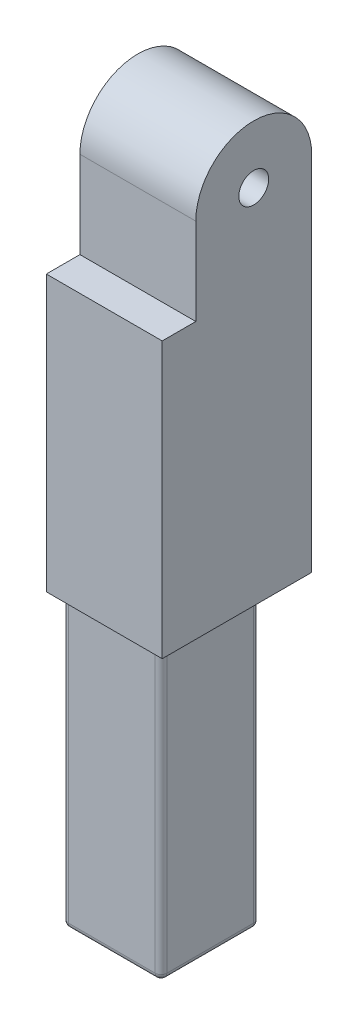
ISO-10303-21;
HEADER;
FILE_DESCRIPTION(('STEP AP214'),'2;1');
FILE_NAME('part.step','',(''),(''),'','','');
FILE_SCHEMA(('AUTOMOTIVE_DESIGN { 1 0 10303 214 1 1 1 1 }'));
ENDSEC;
DATA;
#1=APPLICATION_CONTEXT('core data for automotive mechanical design processes');
#2=APPLICATION_PROTOCOL_DEFINITION('international standard','automotive_design',2000,#1);
#3=PRODUCT_CONTEXT('',#1,'mechanical');
#4=PRODUCT('Part','Part','',(#3));
#5=PRODUCT_RELATED_PRODUCT_CATEGORY('part','',(#4));
#6=PRODUCT_DEFINITION_FORMATION('','',#4);
#7=PRODUCT_DEFINITION_CONTEXT('part definition',#1,'design');
#8=PRODUCT_DEFINITION('design','',#6,#7);
#9=PRODUCT_DEFINITION_SHAPE('','',#8);
#10=(LENGTH_UNIT() NAMED_UNIT(*) SI_UNIT(.MILLI.,.METRE.));
#11=(NAMED_UNIT(*) PLANE_ANGLE_UNIT() SI_UNIT($,.RADIAN.));
#12=(NAMED_UNIT(*) SI_UNIT($,.STERADIAN.) SOLID_ANGLE_UNIT());
#13=UNCERTAINTY_MEASURE_WITH_UNIT(LENGTH_MEASURE(1.E-05),#10,'distance_accuracy_value','');
#14=(GEOMETRIC_REPRESENTATION_CONTEXT(3) GLOBAL_UNCERTAINTY_ASSIGNED_CONTEXT((#13)) GLOBAL_UNIT_ASSIGNED_CONTEXT((#10,
#11,#12)) REPRESENTATION_CONTEXT('',''));
#15=CARTESIAN_POINT('',(0.,0.,0.));
#16=DIRECTION('',(0.,0.,1.));
#17=DIRECTION('',(1.,0.,0.));
#18=AXIS2_PLACEMENT_3D('',#15,#16,#17);
#19=CARTESIAN_POINT('',(0.,-158.75,40.132));
#20=DIRECTION('',(0.,1.,0.));
#21=DIRECTION('',(0.,0.,1.));
#22=AXIS2_PLACEMENT_3D('',#19,#20,#21);
#23=PLANE('',#22);
#24=DIRECTION('',(0.,0.,-1.));
#25=VECTOR('',#24,1.);
#26=CARTESIAN_POINT('',(0.,-158.75,-25.4));
#27=LINE('',#26,#25);
#28=CARTESIAN_POINT('',(0.,-158.75,40.132));
#29=VERTEX_POINT('',#28);
#30=CARTESIAN_POINT('',(0.,-158.75,-25.4));
#31=VERTEX_POINT('',#30);
#32=EDGE_CURVE('E149',#29,#31,#27,.T.);
#33=ORIENTED_EDGE('',*,*,#32,.T.);
#34=DIRECTION('',(1.,0.,0.));
#35=VECTOR('',#34,1.);
#36=CARTESIAN_POINT('',(0.,-158.75,-25.4));
#37=LINE('',#36,#35);
#38=CARTESIAN_POINT('',(50.8,-158.75,-25.4));
#39=VERTEX_POINT('',#38);
#40=EDGE_CURVE('E160',#31,#39,#37,.T.);
#41=ORIENTED_EDGE('',*,*,#40,.T.);
#42=DIRECTION('',(0.,0.,1.));
#43=VECTOR('',#42,1.);
#44=CARTESIAN_POINT('',(50.8,-158.75,-25.4));
#45=LINE('',#44,#43);
#46=CARTESIAN_POINT('',(50.8,-158.75,40.132));
#47=VERTEX_POINT('',#46);
#48=EDGE_CURVE('E166',#39,#47,#45,.T.);
#49=ORIENTED_EDGE('',*,*,#48,.T.);
#50=DIRECTION('',(-1.,0.,0.));
#51=VECTOR('',#50,1.);
#52=CARTESIAN_POINT('',(0.,-158.75,40.132));
#53=LINE('',#52,#51);
#54=EDGE_CURVE('E171',#47,#29,#53,.T.);
#55=ORIENTED_EDGE('',*,*,#54,.T.);
#56=EDGE_LOOP('',(#33,#41,#49,#55));
#57=FACE_BOUND('',#56,.T.);
#58=DIRECTION('',(0.,0.,-1.));
#59=VECTOR('',#58,1.);
#60=CARTESIAN_POINT('',(3.556,-158.75,36.576));
#61=LINE('',#60,#59);
#62=CARTESIAN_POINT('',(3.556,-158.75,34.036));
#63=VERTEX_POINT('',#62);
#64=CARTESIAN_POINT('',(3.55600000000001,-158.75,-4.06400000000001));
#65=VERTEX_POINT('',#64);
#66=EDGE_CURVE('E283',#63,#65,#61,.T.);
#67=ORIENTED_EDGE('',*,*,#66,.F.);
#68=CARTESIAN_POINT('',(6.096,-158.75,34.036));
#69=DIRECTION('',(0.,1.,0.));
#70=DIRECTION('',(0.,0.,1.));
#71=AXIS2_PLACEMENT_3D('',#68,#69,#70);
#72=CIRCLE('',#71,2.54);
#73=CARTESIAN_POINT('',(6.096,-158.75,36.576));
#74=VERTEX_POINT('',#73);
#75=EDGE_CURVE('E245',#63,#74,#72,.T.);
#76=ORIENTED_EDGE('',*,*,#75,.T.);
#77=DIRECTION('',(-1.,0.,0.));
#78=VECTOR('',#77,1.);
#79=CARTESIAN_POINT('',(3.556,-158.75,36.576));
#80=LINE('',#79,#78);
#81=CARTESIAN_POINT('',(44.196,-158.75,36.576));
#82=VERTEX_POINT('',#81);
#83=EDGE_CURVE('E172',#82,#74,#80,.T.);
#84=ORIENTED_EDGE('',*,*,#83,.F.);
#85=CARTESIAN_POINT('',(44.196,-158.75,34.036));
#86=DIRECTION('',(0.,1.,0.));
#87=DIRECTION('',(0.,0.,1.));
#88=AXIS2_PLACEMENT_3D('',#85,#86,#87);
#89=CIRCLE('',#88,2.54);
#90=CARTESIAN_POINT('',(46.736,-158.75,34.036));
#91=VERTEX_POINT('',#90);
#92=EDGE_CURVE('E11',#82,#91,#89,.T.);
#93=ORIENTED_EDGE('',*,*,#92,.T.);
#94=DIRECTION('',(0.,0.,1.));
#95=VECTOR('',#94,1.);
#96=CARTESIAN_POINT('',(46.736,-158.75,36.576));
#97=LINE('',#96,#95);
#98=CARTESIAN_POINT('',(46.736,-158.75,-4.06400000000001));
#99=VERTEX_POINT('',#98);
#100=EDGE_CURVE('E175',#99,#91,#97,.T.);
#101=ORIENTED_EDGE('',*,*,#100,.F.);
#102=CARTESIAN_POINT('',(44.196,-158.75,-4.06400000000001));
#103=DIRECTION('',(0.,1.,0.));
#104=DIRECTION('',(0.,0.,1.));
#105=AXIS2_PLACEMENT_3D('',#102,#103,#104);
#106=CIRCLE('',#105,2.54);
#107=CARTESIAN_POINT('',(44.196,-158.75,-6.604));
#108=VERTEX_POINT('',#107);
#109=EDGE_CURVE('E39',#99,#108,#106,.T.);
#110=ORIENTED_EDGE('',*,*,#109,.T.);
#111=DIRECTION('',(1.,0.,0.));
#112=VECTOR('',#111,1.);
#113=CARTESIAN_POINT('',(3.55600000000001,-158.75,-6.604));
#114=LINE('',#113,#112);
#115=CARTESIAN_POINT('',(6.09600000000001,-158.75,-6.604));
#116=VERTEX_POINT('',#115);
#117=EDGE_CURVE('E285',#116,#108,#114,.T.);
#118=ORIENTED_EDGE('',*,*,#117,.F.);
#119=CARTESIAN_POINT('',(6.09600000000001,-158.75,-4.064));
#120=DIRECTION('',(0.,1.,0.));
#121=DIRECTION('',(0.,0.,1.));
#122=AXIS2_PLACEMENT_3D('',#119,#120,#121);
#123=CIRCLE('',#122,2.54);
#124=EDGE_CURVE('E247',#116,#65,#123,.T.);
#125=ORIENTED_EDGE('',*,*,#124,.T.);
#126=EDGE_LOOP('',(#67,#76,#84,#93,#101,#110,#118,#125));
#127=FACE_BOUND('',#126,.T.);
#128=ADVANCED_FACE('F30',(#57,#127),#23,.F.);
#129=CARTESIAN_POINT('',(101.6,0.,25.4));
#130=DIRECTION('',(0.,0.,-1.));
#131=DIRECTION('',(0.,1.,0.));
#132=AXIS2_PLACEMENT_3D('',#129,#130,#131);
#133=PLANE('',#132);
#134=DIRECTION('',(-1.,0.,0.));
#135=VECTOR('',#134,1.);
#136=CARTESIAN_POINT('',(0.,-38.1,25.4));
#137=LINE('',#136,#135);
#138=CARTESIAN_POINT('',(50.8,-38.1,25.4));
#139=VERTEX_POINT('',#138);
#140=CARTESIAN_POINT('',(0.,-38.1,25.4));
#141=VERTEX_POINT('',#140);
#142=EDGE_CURVE('E181',#139,#141,#137,.T.);
#143=ORIENTED_EDGE('',*,*,#142,.F.);
#144=DIRECTION('',(0.,-1.,0.));
#145=VECTOR('',#144,1.);
#146=CARTESIAN_POINT('',(50.8,35.691683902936,25.4));
#147=LINE('',#146,#145);
#148=CARTESIAN_POINT('',(50.8,0.,25.4));
#149=VERTEX_POINT('',#148);
#150=EDGE_CURVE('E194',#149,#139,#147,.T.);
#151=ORIENTED_EDGE('',*,*,#150,.F.);
#152=DIRECTION('',(-1.,0.,0.));
#153=VECTOR('',#152,1.);
#154=CARTESIAN_POINT('',(101.6,0.,25.4));
#155=LINE('',#154,#153);
#156=CARTESIAN_POINT('',(0.,0.,25.4));
#157=VERTEX_POINT('',#156);
#158=EDGE_CURVE('E209',#149,#157,#155,.T.);
#159=ORIENTED_EDGE('',*,*,#158,.T.);
#160=DIRECTION('',(0.,-1.,0.));
#161=VECTOR('',#160,1.);
#162=CARTESIAN_POINT('',(0.,0.,25.4));
#163=LINE('',#162,#161);
#164=EDGE_CURVE('E157',#157,#141,#163,.T.);
#165=ORIENTED_EDGE('',*,*,#164,.T.);
#166=EDGE_LOOP('',(#143,#151,#159,#165));
#167=FACE_BOUND('',#166,.T.);
#168=ADVANCED_FACE('F357',(#167),#133,.F.);
#169=CARTESIAN_POINT('',(0.,0.,0.));
#170=DIRECTION('',(1.,0.,0.));
#171=DIRECTION('',(0.,0.,-1.));
#172=AXIS2_PLACEMENT_3D('',#169,#170,#171);
#173=PLANE('',#172);
#174=CARTESIAN_POINT('',(0.,0.,0.));
#175=DIRECTION('',(1.,0.,0.));
#176=DIRECTION('',(0.,0.,-1.));
#177=AXIS2_PLACEMENT_3D('',#174,#175,#176);
#178=CIRCLE('',#177,6.54812);
#179=CARTESIAN_POINT('',(0.,0.,-6.54812));
#180=VERTEX_POINT('',#179);
#181=EDGE_CURVE('E202',#180,#180,#178,.T.);
#182=ORIENTED_EDGE('',*,*,#181,.T.);
#183=EDGE_LOOP('',(#182));
#184=FACE_BOUND('',#183,.T.);
#185=DIRECTION('',(0.,1.,0.));
#186=VECTOR('',#185,1.);
#187=CARTESIAN_POINT('',(0.,0.,-25.4));
#188=LINE('',#187,#186);
#189=CARTESIAN_POINT('',(0.,0.,-25.4));
#190=VERTEX_POINT('',#189);
#191=EDGE_CURVE('E144',#31,#190,#188,.T.);
#192=ORIENTED_EDGE('',*,*,#191,.F.);
#193=ORIENTED_EDGE('',*,*,#32,.F.);
#194=DIRECTION('',(0.,-1.,0.));
#195=VECTOR('',#194,1.);
#196=CARTESIAN_POINT('',(0.,-107.95,40.132));
#197=LINE('',#196,#195);
#198=CARTESIAN_POINT('',(0.,-38.1,40.132));
#199=VERTEX_POINT('',#198);
#200=EDGE_CURVE('E182',#199,#29,#197,.T.);
#201=ORIENTED_EDGE('',*,*,#200,.F.);
#202=DIRECTION('',(0.,0.,-1.));
#203=VECTOR('',#202,1.);
#204=CARTESIAN_POINT('',(0.,-38.1,40.132));
#205=LINE('',#204,#203);
#206=EDGE_CURVE('E188',#199,#141,#205,.T.);
#207=ORIENTED_EDGE('',*,*,#206,.T.);
#208=ORIENTED_EDGE('',*,*,#164,.F.);
#209=CARTESIAN_POINT('',(0.,0.,0.));
#210=DIRECTION('',(1.,0.,0.));
#211=DIRECTION('',(0.,0.,-1.));
#212=AXIS2_PLACEMENT_3D('',#209,#210,#211);
#213=CIRCLE('',#212,25.4);
#214=EDGE_CURVE('E152',#190,#157,#213,.T.);
#215=ORIENTED_EDGE('',*,*,#214,.F.);
#216=EDGE_LOOP('',(#192,#193,#201,#207,#208,#215));
#217=FACE_BOUND('',#216,.T.);
#218=ADVANCED_FACE('F146',(#184,#217),#173,.F.);
#219=CARTESIAN_POINT('',(50.8,35.691683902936,-25.4));
#220=DIRECTION('',(-1.,0.,0.));
#221=DIRECTION('',(0.,-1.,0.));
#222=AXIS2_PLACEMENT_3D('',#219,#220,#221);
#223=PLANE('',#222);
#224=CARTESIAN_POINT('',(50.8,0.,0.));
#225=DIRECTION('',(-1.,0.,0.));
#226=DIRECTION('',(0.,-1.,0.));
#227=AXIS2_PLACEMENT_3D('',#224,#225,#226);
#228=CIRCLE('',#227,6.54812);
#229=CARTESIAN_POINT('',(50.8,-6.54812,0.));
#230=VERTEX_POINT('',#229);
#231=EDGE_CURVE('E196',#230,#230,#228,.T.);
#232=ORIENTED_EDGE('',*,*,#231,.T.);
#233=EDGE_LOOP('',(#232));
#234=FACE_BOUND('',#233,.T.);
#235=ORIENTED_EDGE('',*,*,#150,.T.);
#236=DIRECTION('',(0.,0.,-1.));
#237=VECTOR('',#236,1.);
#238=CARTESIAN_POINT('',(50.8,-38.1,40.132));
#239=LINE('',#238,#237);
#240=CARTESIAN_POINT('',(50.8,-38.1,40.132));
#241=VERTEX_POINT('',#240);
#242=EDGE_CURVE('E192',#241,#139,#239,.T.);
#243=ORIENTED_EDGE('',*,*,#242,.F.);
#244=DIRECTION('',(0.,1.,0.));
#245=VECTOR('',#244,1.);
#246=CARTESIAN_POINT('',(50.8,-107.95,40.132));
#247=LINE('',#246,#245);
#248=EDGE_CURVE('E184',#47,#241,#247,.T.);
#249=ORIENTED_EDGE('',*,*,#248,.F.);
#250=ORIENTED_EDGE('',*,*,#48,.F.);
#251=DIRECTION('',(0.,-1.,0.));
#252=VECTOR('',#251,1.);
#253=CARTESIAN_POINT('',(50.8,35.691683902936,-25.4));
#254=LINE('',#253,#252);
#255=CARTESIAN_POINT('',(50.8,0.,-25.4));
#256=VERTEX_POINT('',#255);
#257=EDGE_CURVE('E162',#256,#39,#254,.T.);
#258=ORIENTED_EDGE('',*,*,#257,.F.);
#259=CARTESIAN_POINT('',(50.8,0.,0.));
#260=DIRECTION('',(-1.,0.,0.));
#261=DIRECTION('',(0.,-1.,0.));
#262=AXIS2_PLACEMENT_3D('',#259,#260,#261);
#263=CIRCLE('',#262,25.4);
#264=EDGE_CURVE('E199',#149,#256,#263,.T.);
#265=ORIENTED_EDGE('',*,*,#264,.F.);
#266=EDGE_LOOP('',(#235,#243,#249,#250,#258,#265));
#267=FACE_BOUND('',#266,.T.);
#268=ADVANCED_FACE('F377',(#234,#267),#223,.F.);
#269=CARTESIAN_POINT('',(101.6,0.,-25.4));
#270=DIRECTION('',(0.,0.,1.));
#271=DIRECTION('',(0.,-1.,0.));
#272=AXIS2_PLACEMENT_3D('',#269,#270,#271);
#273=PLANE('',#272);
#274=ORIENTED_EDGE('',*,*,#257,.T.);
#275=ORIENTED_EDGE('',*,*,#40,.F.);
#276=ORIENTED_EDGE('',*,*,#191,.T.);
#277=DIRECTION('',(-1.,0.,0.));
#278=VECTOR('',#277,1.);
#279=CARTESIAN_POINT('',(101.6,0.,-25.4));
#280=LINE('',#279,#278);
#281=EDGE_CURVE('E156',#256,#190,#280,.T.);
#282=ORIENTED_EDGE('',*,*,#281,.F.);
#283=EDGE_LOOP('',(#274,#275,#276,#282));
#284=FACE_BOUND('',#283,.T.);
#285=ADVANCED_FACE('F161',(#284),#273,.F.);
#286=CARTESIAN_POINT('',(101.6,0.,0.));
#287=DIRECTION('',(-1.,0.,0.));
#288=DIRECTION('',(0.,0.,1.));
#289=AXIS2_PLACEMENT_3D('',#286,#287,#288);
#290=CYLINDRICAL_SURFACE('',#289,25.4);
#291=ORIENTED_EDGE('',*,*,#158,.F.);
#292=ORIENTED_EDGE('',*,*,#264,.T.);
#293=ORIENTED_EDGE('',*,*,#281,.T.);
#294=ORIENTED_EDGE('',*,*,#214,.T.);
#295=EDGE_LOOP('',(#291,#292,#293,#294));
#296=FACE_BOUND('',#295,.T.);
#297=ADVANCED_FACE('F383',(#296),#290,.T.);
#298=CARTESIAN_POINT('',(101.6,0.,0.));
#299=DIRECTION('',(-1.,0.,0.));
#300=DIRECTION('',(0.,0.,1.));
#301=AXIS2_PLACEMENT_3D('',#298,#299,#300);
#302=CYLINDRICAL_SURFACE('',#301,6.54812);
#303=ORIENTED_EDGE('',*,*,#231,.F.);
#304=EDGE_LOOP('',(#303));
#305=FACE_BOUND('',#304,.T.);
#306=ORIENTED_EDGE('',*,*,#181,.F.);
#307=EDGE_LOOP('',(#306));
#308=FACE_BOUND('',#307,.T.);
#309=ADVANCED_FACE('F375',(#305,#308),#302,.F.);
#310=CARTESIAN_POINT('',(0.,-38.1,40.132));
#311=DIRECTION('',(0.,-1.,0.));
#312=DIRECTION('',(0.,0.,-1.));
#313=AXIS2_PLACEMENT_3D('',#310,#311,#312);
#314=PLANE('',#313);
#315=ORIENTED_EDGE('',*,*,#142,.T.);
#316=ORIENTED_EDGE('',*,*,#206,.F.);
#317=DIRECTION('',(-1.,0.,0.));
#318=VECTOR('',#317,1.);
#319=CARTESIAN_POINT('',(0.,-38.1,40.132));
#320=LINE('',#319,#318);
#321=EDGE_CURVE('E186',#241,#199,#320,.T.);
#322=ORIENTED_EDGE('',*,*,#321,.F.);
#323=ORIENTED_EDGE('',*,*,#242,.T.);
#324=EDGE_LOOP('',(#315,#316,#322,#323));
#325=FACE_BOUND('',#324,.T.);
#326=ADVANCED_FACE('F371',(#325),#314,.F.);
#327=CARTESIAN_POINT('',(0.,-38.1,40.132));
#328=DIRECTION('',(0.,0.,-1.));
#329=DIRECTION('',(-1.,0.,0.));
#330=AXIS2_PLACEMENT_3D('',#327,#328,#329);
#331=PLANE('',#330);
#332=ORIENTED_EDGE('',*,*,#200,.T.);
#333=ORIENTED_EDGE('',*,*,#54,.F.);
#334=ORIENTED_EDGE('',*,*,#248,.T.);
#335=ORIENTED_EDGE('',*,*,#321,.T.);
#336=EDGE_LOOP('',(#332,#333,#334,#335));
#337=FACE_BOUND('',#336,.T.);
#338=ADVANCED_FACE('F368',(#337),#331,.F.);
#339=CARTESIAN_POINT('',(3.556,-285.75,36.576));
#340=DIRECTION('',(1.,0.,0.));
#341=DIRECTION('',(0.,0.,-1.));
#342=AXIS2_PLACEMENT_3D('',#339,#340,#341);
#343=PLANE('',#342);
#344=DIRECTION('',(0.,0.,-1.));
#345=VECTOR('',#344,1.);
#346=CARTESIAN_POINT('',(3.556,-283.21,36.576));
#347=LINE('',#346,#345);
#348=CARTESIAN_POINT('',(3.55600000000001,-283.21,-4.06400000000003));
#349=VERTEX_POINT('',#348);
#350=CARTESIAN_POINT('',(3.556,-283.21,34.036));
#351=VERTEX_POINT('',#350);
#352=EDGE_CURVE('E47',#349,#351,#347,.F.);
#353=ORIENTED_EDGE('',*,*,#352,.T.);
#354=DIRECTION('',(0.,1.,0.));
#355=VECTOR('',#354,1.);
#356=CARTESIAN_POINT('',(3.556,-285.75,34.036));
#357=LINE('',#356,#355);
#358=EDGE_CURVE('E243',#351,#63,#357,.T.);
#359=ORIENTED_EDGE('',*,*,#358,.T.);
#360=ORIENTED_EDGE('',*,*,#66,.T.);
#361=DIRECTION('',(0.,1.,0.));
#362=VECTOR('',#361,1.);
#363=CARTESIAN_POINT('',(3.55600000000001,-285.75,-4.06400000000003));
#364=LINE('',#363,#362);
#365=EDGE_CURVE('E52',#65,#349,#364,.F.);
#366=ORIENTED_EDGE('',*,*,#365,.T.);
#367=EDGE_LOOP('',(#353,#359,#360,#366));
#368=FACE_BOUND('',#367,.T.);
#369=ADVANCED_FACE('F366',(#368),#343,.F.);
#370=CARTESIAN_POINT('',(3.55600000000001,-285.75,-6.60400000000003));
#371=DIRECTION('',(0.,0.,1.));
#372=DIRECTION('',(0.,-1.,0.));
#373=AXIS2_PLACEMENT_3D('',#370,#371,#372);
#374=PLANE('',#373);
#375=DIRECTION('',(1.,0.,0.));
#376=VECTOR('',#375,1.);
#377=CARTESIAN_POINT('',(3.55600000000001,-283.21,-6.60400000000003));
#378=LINE('',#377,#376);
#379=CARTESIAN_POINT('',(44.196,-283.21,-6.60400000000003));
#380=VERTEX_POINT('',#379);
#381=CARTESIAN_POINT('',(6.09600000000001,-283.21,-6.60400000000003));
#382=VERTEX_POINT('',#381);
#383=EDGE_CURVE('E237',#380,#382,#378,.F.);
#384=ORIENTED_EDGE('',*,*,#383,.T.);
#385=DIRECTION('',(0.,1.,0.));
#386=VECTOR('',#385,1.);
#387=CARTESIAN_POINT('',(6.09600000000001,-285.75,-6.60400000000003));
#388=LINE('',#387,#386);
#389=EDGE_CURVE('E239',#382,#116,#388,.T.);
#390=ORIENTED_EDGE('',*,*,#389,.T.);
#391=ORIENTED_EDGE('',*,*,#117,.T.);
#392=DIRECTION('',(0.,1.,0.));
#393=VECTOR('',#392,1.);
#394=CARTESIAN_POINT('',(44.196,-285.75,-6.60400000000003));
#395=LINE('',#394,#393);
#396=EDGE_CURVE('E235',#108,#380,#395,.F.);
#397=ORIENTED_EDGE('',*,*,#396,.T.);
#398=EDGE_LOOP('',(#384,#390,#391,#397));
#399=FACE_BOUND('',#398,.T.);
#400=ADVANCED_FACE('F316',(#399),#374,.F.);
#401=CARTESIAN_POINT('',(46.736,-285.75,36.576));
#402=DIRECTION('',(-1.,0.,0.));
#403=DIRECTION('',(0.,0.,1.));
#404=AXIS2_PLACEMENT_3D('',#401,#402,#403);
#405=PLANE('',#404);
#406=DIRECTION('',(0.,0.,1.));
#407=VECTOR('',#406,1.);
#408=CARTESIAN_POINT('',(46.736,-283.21,-6.60400000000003));
#409=LINE('',#408,#407);
#410=CARTESIAN_POINT('',(46.736,-283.21,34.036));
#411=VERTEX_POINT('',#410);
#412=CARTESIAN_POINT('',(46.736,-283.21,-4.06400000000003));
#413=VERTEX_POINT('',#412);
#414=EDGE_CURVE('E231',#411,#413,#409,.F.);
#415=ORIENTED_EDGE('',*,*,#414,.T.);
#416=DIRECTION('',(0.,1.,0.));
#417=VECTOR('',#416,1.);
#418=CARTESIAN_POINT('',(46.736,-285.75,-4.06400000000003));
#419=LINE('',#418,#417);
#420=EDGE_CURVE('E233',#413,#99,#419,.T.);
#421=ORIENTED_EDGE('',*,*,#420,.T.);
#422=ORIENTED_EDGE('',*,*,#100,.T.);
#423=DIRECTION('',(0.,1.,0.));
#424=VECTOR('',#423,1.);
#425=CARTESIAN_POINT('',(46.736,-285.75,34.036));
#426=LINE('',#425,#424);
#427=EDGE_CURVE('E229',#91,#411,#426,.F.);
#428=ORIENTED_EDGE('',*,*,#427,.T.);
#429=EDGE_LOOP('',(#415,#421,#422,#428));
#430=FACE_BOUND('',#429,.T.);
#431=ADVANCED_FACE('F294',(#430),#405,.F.);
#432=CARTESIAN_POINT('',(3.556,-285.75,36.576));
#433=DIRECTION('',(0.,0.,-1.));
#434=DIRECTION('',(0.,1.,0.));
#435=AXIS2_PLACEMENT_3D('',#432,#433,#434);
#436=PLANE('',#435);
#437=ORIENTED_EDGE('',*,*,#83,.T.);
#438=DIRECTION('',(0.,1.,0.));
#439=VECTOR('',#438,1.);
#440=CARTESIAN_POINT('',(6.096,-285.75,36.576));
#441=LINE('',#440,#439);
#442=CARTESIAN_POINT('',(6.096,-283.21,36.576));
#443=VERTEX_POINT('',#442);
#444=EDGE_CURVE('E227',#74,#443,#441,.F.);
#445=ORIENTED_EDGE('',*,*,#444,.T.);
#446=DIRECTION('',(-1.,0.,0.));
#447=VECTOR('',#446,1.);
#448=CARTESIAN_POINT('',(46.736,-283.21,36.576));
#449=LINE('',#448,#447);
#450=CARTESIAN_POINT('',(44.196,-283.21,36.576));
#451=VERTEX_POINT('',#450);
#452=EDGE_CURVE('E224',#443,#451,#449,.F.);
#453=ORIENTED_EDGE('',*,*,#452,.T.);
#454=DIRECTION('',(0.,1.,0.));
#455=VECTOR('',#454,1.);
#456=CARTESIAN_POINT('',(44.196,-285.75,36.576));
#457=LINE('',#456,#455);
#458=EDGE_CURVE('E222',#451,#82,#457,.T.);
#459=ORIENTED_EDGE('',*,*,#458,.T.);
#460=EDGE_LOOP('',(#437,#445,#453,#459));
#461=FACE_BOUND('',#460,.T.);
#462=ADVANCED_FACE('F344',(#461),#436,.F.);
#463=CARTESIAN_POINT('',(3.55600000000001,-285.75,-6.60400000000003));
#464=DIRECTION('',(0.,-1.,0.));
#465=DIRECTION('',(0.,0.,-1.));
#466=AXIS2_PLACEMENT_3D('',#463,#464,#465);
#467=PLANE('',#466);
#468=DIRECTION('',(0.,0.,1.));
#469=VECTOR('',#468,1.);
#470=CARTESIAN_POINT('',(44.196,-285.75,36.576));
#471=LINE('',#470,#469);
#472=CARTESIAN_POINT('',(44.196,-285.75,-4.06400000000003));
#473=VERTEX_POINT('',#472);
#474=CARTESIAN_POINT('',(44.196,-285.75,34.036));
#475=VERTEX_POINT('',#474);
#476=EDGE_CURVE('E217',#473,#475,#471,.T.);
#477=ORIENTED_EDGE('',*,*,#476,.T.);
#478=DIRECTION('',(-1.,0.,0.));
#479=VECTOR('',#478,1.);
#480=CARTESIAN_POINT('',(3.556,-285.75,34.036));
#481=LINE('',#480,#479);
#482=CARTESIAN_POINT('',(6.096,-285.75,34.036));
#483=VERTEX_POINT('',#482);
#484=EDGE_CURVE('E219',#475,#483,#481,.T.);
#485=ORIENTED_EDGE('',*,*,#484,.T.);
#486=DIRECTION('',(0.,0.,-1.));
#487=VECTOR('',#486,1.);
#488=CARTESIAN_POINT('',(6.09600000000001,-285.75,-6.60400000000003));
#489=LINE('',#488,#487);
#490=CARTESIAN_POINT('',(6.09600000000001,-285.75,-4.06400000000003));
#491=VERTEX_POINT('',#490);
#492=EDGE_CURVE('E211',#483,#491,#489,.T.);
#493=ORIENTED_EDGE('',*,*,#492,.T.);
#494=DIRECTION('',(1.,0.,0.));
#495=VECTOR('',#494,1.);
#496=CARTESIAN_POINT('',(46.736,-285.75,-4.06400000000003));
#497=LINE('',#496,#495);
#498=EDGE_CURVE('E215',#491,#473,#497,.T.);
#499=ORIENTED_EDGE('',*,*,#498,.T.);
#500=EDGE_LOOP('',(#477,#485,#493,#499));
#501=FACE_BOUND('',#500,.T.);
#502=ADVANCED_FACE('F347',(#501),#467,.T.);
#503=CARTESIAN_POINT('',(44.196,-285.75,-4.06400000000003));
#504=DIRECTION('',(0.,1.,0.));
#505=DIRECTION('',(0.,0.,1.));
#506=AXIS2_PLACEMENT_3D('',#503,#504,#505);
#507=CYLINDRICAL_SURFACE('',#506,2.54);
#508=ORIENTED_EDGE('',*,*,#109,.F.);
#509=ORIENTED_EDGE('',*,*,#420,.F.);
#510=CARTESIAN_POINT('',(44.196,-283.21,-4.06400000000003));
#511=DIRECTION('',(0.,-1.,0.));
#512=DIRECTION('',(0.,0.,-1.));
#513=AXIS2_PLACEMENT_3D('',#510,#511,#512);
#514=CIRCLE('',#513,2.54);
#515=EDGE_CURVE('E34',#380,#413,#514,.T.);
#516=ORIENTED_EDGE('',*,*,#515,.F.);
#517=ORIENTED_EDGE('',*,*,#396,.F.);
#518=EDGE_LOOP('',(#508,#509,#516,#517));
#519=FACE_BOUND('',#518,.T.);
#520=ADVANCED_FACE('F32',(#519),#507,.T.);
#521=CARTESIAN_POINT('',(3.55600000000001,-283.21,-4.06400000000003));
#522=DIRECTION('',(-1.,0.,0.));
#523=DIRECTION('',(0.,0.,1.));
#524=AXIS2_PLACEMENT_3D('',#521,#522,#523);
#525=CYLINDRICAL_SURFACE('',#524,2.54);
#526=CARTESIAN_POINT('',(6.09600000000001,-283.21,-4.06400000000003));
#527=DIRECTION('',(-1.,0.,0.));
#528=DIRECTION('',(0.,0.,1.));
#529=AXIS2_PLACEMENT_3D('',#526,#527,#528);
#530=CIRCLE('',#529,2.54);
#531=EDGE_CURVE('E275',#382,#491,#530,.T.);
#532=ORIENTED_EDGE('',*,*,#531,.F.);
#533=ORIENTED_EDGE('',*,*,#383,.F.);
#534=CARTESIAN_POINT('',(44.196,-283.21,-4.06400000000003));
#535=DIRECTION('',(1.,0.,0.));
#536=DIRECTION('',(0.,0.,-1.));
#537=AXIS2_PLACEMENT_3D('',#534,#535,#536);
#538=CIRCLE('',#537,2.54);
#539=EDGE_CURVE('E277',#473,#380,#538,.T.);
#540=ORIENTED_EDGE('',*,*,#539,.F.);
#541=ORIENTED_EDGE('',*,*,#498,.F.);
#542=EDGE_LOOP('',(#532,#533,#540,#541));
#543=FACE_BOUND('',#542,.T.);
#544=ADVANCED_FACE('F325',(#543),#525,.T.);
#545=CARTESIAN_POINT('',(6.09600000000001,-285.75,-4.06400000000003));
#546=DIRECTION('',(0.,1.,0.));
#547=DIRECTION('',(0.,0.,1.));
#548=AXIS2_PLACEMENT_3D('',#545,#546,#547);
#549=CYLINDRICAL_SURFACE('',#548,2.54);
#550=ORIENTED_EDGE('',*,*,#124,.F.);
#551=ORIENTED_EDGE('',*,*,#389,.F.);
#552=CARTESIAN_POINT('',(6.09600000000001,-283.21,-4.06400000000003));
#553=DIRECTION('',(0.,-1.,0.));
#554=DIRECTION('',(0.,0.,-1.));
#555=AXIS2_PLACEMENT_3D('',#552,#553,#554);
#556=CIRCLE('',#555,2.54);
#557=EDGE_CURVE('E272',#349,#382,#556,.T.);
#558=ORIENTED_EDGE('',*,*,#557,.F.);
#559=ORIENTED_EDGE('',*,*,#365,.F.);
#560=EDGE_LOOP('',(#550,#551,#558,#559));
#561=FACE_BOUND('',#560,.T.);
#562=ADVANCED_FACE('F321',(#561),#549,.T.);
#563=CARTESIAN_POINT('',(44.196,-283.21,-4.06400000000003));
#564=DIRECTION('',(0.,0.,1.));
#565=DIRECTION('',(1.,0.,0.));
#566=AXIS2_PLACEMENT_3D('',#563,#564,#565);
#567=SPHERICAL_SURFACE('',#566,2.54);
#568=ORIENTED_EDGE('',*,*,#539,.T.);
#569=ORIENTED_EDGE('',*,*,#515,.T.);
#570=CARTESIAN_POINT('',(44.196,-283.21,-4.06400000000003));
#571=DIRECTION('',(0.,0.,-1.));
#572=DIRECTION('',(0.,1.,0.));
#573=AXIS2_PLACEMENT_3D('',#570,#571,#572);
#574=CIRCLE('',#573,2.54);
#575=EDGE_CURVE('E269',#473,#413,#574,.F.);
#576=ORIENTED_EDGE('',*,*,#575,.F.);
#577=EDGE_LOOP('',(#568,#569,#576));
#578=FACE_BOUND('',#577,.T.);
#579=ADVANCED_FACE('F409',(#578),#567,.T.);
#580=CARTESIAN_POINT('',(6.09600000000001,-283.21,-4.06400000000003));
#581=DIRECTION('',(0.,0.,1.));
#582=DIRECTION('',(1.,0.,0.));
#583=AXIS2_PLACEMENT_3D('',#580,#581,#582);
#584=SPHERICAL_SURFACE('',#583,2.54);
#585=ORIENTED_EDGE('',*,*,#557,.T.);
#586=ORIENTED_EDGE('',*,*,#531,.T.);
#587=CARTESIAN_POINT('',(6.09600000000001,-283.21,-4.06400000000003));
#588=DIRECTION('',(0.,0.,-1.));
#589=DIRECTION('',(-1.,0.,0.));
#590=AXIS2_PLACEMENT_3D('',#587,#588,#589);
#591=CIRCLE('',#590,2.54);
#592=EDGE_CURVE('E266',#349,#491,#591,.F.);
#593=ORIENTED_EDGE('',*,*,#592,.F.);
#594=EDGE_LOOP('',(#585,#586,#593));
#595=FACE_BOUND('',#594,.T.);
#596=ADVANCED_FACE('F327',(#595),#584,.T.);
#597=CARTESIAN_POINT('',(44.196,-285.75,34.036));
#598=DIRECTION('',(0.,1.,0.));
#599=DIRECTION('',(0.,0.,1.));
#600=AXIS2_PLACEMENT_3D('',#597,#598,#599);
#601=CYLINDRICAL_SURFACE('',#600,2.54);
#602=ORIENTED_EDGE('',*,*,#92,.F.);
#603=ORIENTED_EDGE('',*,*,#458,.F.);
#604=CARTESIAN_POINT('',(44.196,-283.21,34.036));
#605=DIRECTION('',(0.,-1.,0.));
#606=DIRECTION('',(0.,0.,-1.));
#607=AXIS2_PLACEMENT_3D('',#604,#605,#606);
#608=CIRCLE('',#607,2.54);
#609=EDGE_CURVE('E263',#411,#451,#608,.T.);
#610=ORIENTED_EDGE('',*,*,#609,.F.);
#611=ORIENTED_EDGE('',*,*,#427,.F.);
#612=EDGE_LOOP('',(#602,#603,#610,#611));
#613=FACE_BOUND('',#612,.T.);
#614=ADVANCED_FACE('F301',(#613),#601,.T.);
#615=CARTESIAN_POINT('',(44.196,-283.21,-6.60400000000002));
#616=DIRECTION('',(0.,0.,-1.));
#617=DIRECTION('',(-1.,0.,0.));
#618=AXIS2_PLACEMENT_3D('',#615,#616,#617);
#619=CYLINDRICAL_SURFACE('',#618,2.54);
#620=ORIENTED_EDGE('',*,*,#575,.T.);
#621=ORIENTED_EDGE('',*,*,#414,.F.);
#622=CARTESIAN_POINT('',(44.196,-283.21,34.036));
#623=DIRECTION('',(0.,0.,1.));
#624=DIRECTION('',(1.,0.,0.));
#625=AXIS2_PLACEMENT_3D('',#622,#623,#624);
#626=CIRCLE('',#625,2.54);
#627=EDGE_CURVE('E260',#475,#411,#626,.T.);
#628=ORIENTED_EDGE('',*,*,#627,.F.);
#629=ORIENTED_EDGE('',*,*,#476,.F.);
#630=EDGE_LOOP('',(#620,#621,#628,#629));
#631=FACE_BOUND('',#630,.T.);
#632=ADVANCED_FACE('F310',(#631),#619,.T.);
#633=CARTESIAN_POINT('',(6.09600000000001,-283.21,-6.60400000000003));
#634=DIRECTION('',(0.,0.,1.));
#635=DIRECTION('',(1.,0.,0.));
#636=AXIS2_PLACEMENT_3D('',#633,#634,#635);
#637=CYLINDRICAL_SURFACE('',#636,2.54);
#638=ORIENTED_EDGE('',*,*,#592,.T.);
#639=ORIENTED_EDGE('',*,*,#492,.F.);
#640=CARTESIAN_POINT('',(6.096,-283.21,34.036));
#641=DIRECTION('',(0.,0.,1.));
#642=DIRECTION('',(1.,0.,0.));
#643=AXIS2_PLACEMENT_3D('',#640,#641,#642);
#644=CIRCLE('',#643,2.54);
#645=EDGE_CURVE('E257',#351,#483,#644,.T.);
#646=ORIENTED_EDGE('',*,*,#645,.F.);
#647=ORIENTED_EDGE('',*,*,#352,.F.);
#648=EDGE_LOOP('',(#638,#639,#646,#647));
#649=FACE_BOUND('',#648,.T.);
#650=ADVANCED_FACE('F331',(#649),#637,.T.);
#651=CARTESIAN_POINT('',(6.096,-285.75,34.036));
#652=DIRECTION('',(0.,1.,0.));
#653=DIRECTION('',(0.,0.,1.));
#654=AXIS2_PLACEMENT_3D('',#651,#652,#653);
#655=CYLINDRICAL_SURFACE('',#654,2.54);
#656=ORIENTED_EDGE('',*,*,#75,.F.);
#657=ORIENTED_EDGE('',*,*,#358,.F.);
#658=CARTESIAN_POINT('',(6.096,-283.21,34.036));
#659=DIRECTION('',(0.,-1.,0.));
#660=DIRECTION('',(0.,0.,-1.));
#661=AXIS2_PLACEMENT_3D('',#658,#659,#660);
#662=CIRCLE('',#661,2.54);
#663=EDGE_CURVE('E254',#443,#351,#662,.T.);
#664=ORIENTED_EDGE('',*,*,#663,.F.);
#665=ORIENTED_EDGE('',*,*,#444,.F.);
#666=EDGE_LOOP('',(#656,#657,#664,#665));
#667=FACE_BOUND('',#666,.T.);
#668=ADVANCED_FACE('F340',(#667),#655,.T.);
#669=CARTESIAN_POINT('',(44.196,-283.21,34.036));
#670=DIRECTION('',(0.,0.,1.));
#671=DIRECTION('',(1.,0.,0.));
#672=AXIS2_PLACEMENT_3D('',#669,#670,#671);
#673=SPHERICAL_SURFACE('',#672,2.54);
#674=ORIENTED_EDGE('',*,*,#627,.T.);
#675=ORIENTED_EDGE('',*,*,#609,.T.);
#676=CARTESIAN_POINT('',(44.196,-283.21,34.036));
#677=DIRECTION('',(1.,0.,0.));
#678=DIRECTION('',(0.,0.,-1.));
#679=AXIS2_PLACEMENT_3D('',#676,#677,#678);
#680=CIRCLE('',#679,2.54);
#681=EDGE_CURVE('E252',#475,#451,#680,.F.);
#682=ORIENTED_EDGE('',*,*,#681,.F.);
#683=EDGE_LOOP('',(#674,#675,#682));
#684=FACE_BOUND('',#683,.T.);
#685=ADVANCED_FACE('F306',(#684),#673,.T.);
#686=CARTESIAN_POINT('',(6.096,-283.21,34.036));
#687=DIRECTION('',(0.,0.,1.));
#688=DIRECTION('',(1.,0.,0.));
#689=AXIS2_PLACEMENT_3D('',#686,#687,#688);
#690=SPHERICAL_SURFACE('',#689,2.54);
#691=ORIENTED_EDGE('',*,*,#663,.T.);
#692=ORIENTED_EDGE('',*,*,#645,.T.);
#693=CARTESIAN_POINT('',(6.096,-283.21,34.036));
#694=DIRECTION('',(-1.,0.,0.));
#695=DIRECTION('',(0.,0.,1.));
#696=AXIS2_PLACEMENT_3D('',#693,#694,#695);
#697=CIRCLE('',#696,2.54);
#698=EDGE_CURVE('E250',#443,#483,#697,.F.);
#699=ORIENTED_EDGE('',*,*,#698,.F.);
#700=EDGE_LOOP('',(#691,#692,#699));
#701=FACE_BOUND('',#700,.T.);
#702=ADVANCED_FACE('F335',(#701),#690,.T.);
#703=CARTESIAN_POINT('',(3.55600000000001,-283.21,34.036));
#704=DIRECTION('',(1.,0.,0.));
#705=DIRECTION('',(0.,0.,-1.));
#706=AXIS2_PLACEMENT_3D('',#703,#704,#705);
#707=CYLINDRICAL_SURFACE('',#706,2.54);
#708=ORIENTED_EDGE('',*,*,#681,.T.);
#709=ORIENTED_EDGE('',*,*,#452,.F.);
#710=ORIENTED_EDGE('',*,*,#698,.T.);
#711=ORIENTED_EDGE('',*,*,#484,.F.);
#712=EDGE_LOOP('',(#708,#709,#710,#711));
#713=FACE_BOUND('',#712,.T.);
#714=ADVANCED_FACE('F342',(#713),#707,.T.);
#715=CLOSED_SHELL('',(#128,#168,#218,#268,#285,#297,#309,#326,#338,#369,#400,#431,#462,#502,
#520,#544,#562,#579,#596,#614,#632,#650,#668,#685,#702,#714));
#716=MANIFOLD_SOLID_BREP('B2',#715);
#717=ADVANCED_BREP_SHAPE_REPRESENTATION('',(#18,#716),#14);
#718=SHAPE_DEFINITION_REPRESENTATION(#9,#717);
ENDSEC;
END-ISO-10303-21;
